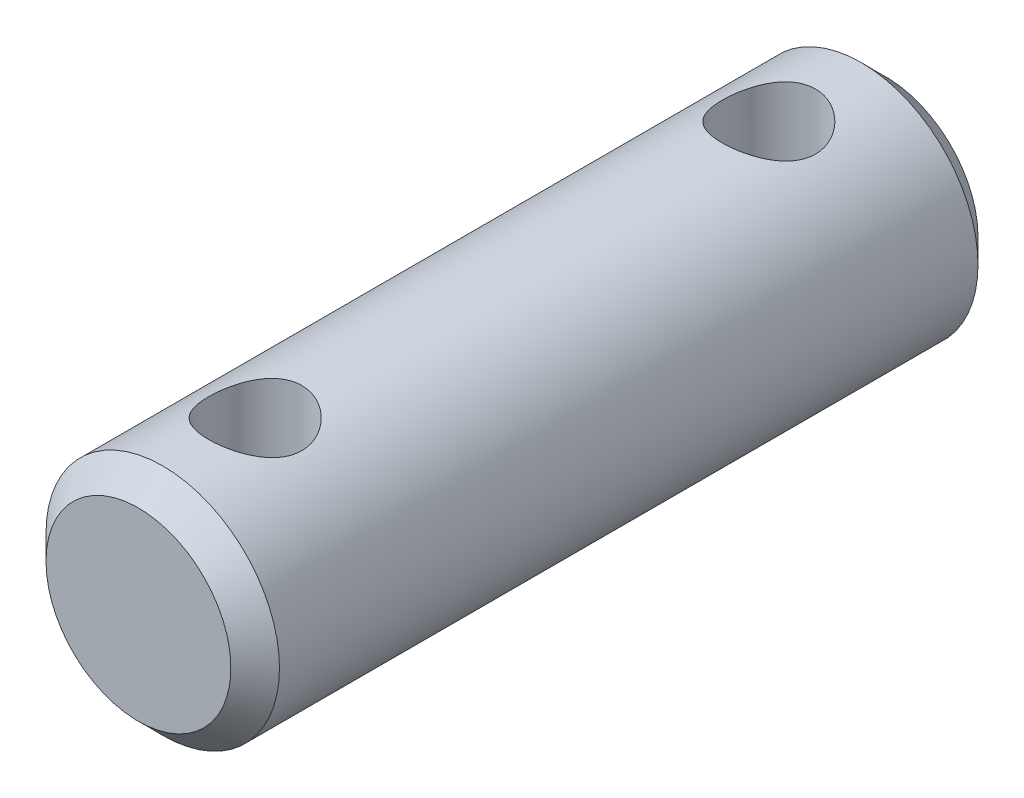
ISO-10303-21;
HEADER;
FILE_DESCRIPTION(('STEP AP214'),'2;1');
FILE_NAME('part.step','',(''),(''),'','','');
FILE_SCHEMA(('AUTOMOTIVE_DESIGN { 1 0 10303 214 1 1 1 1 }'));
ENDSEC;
DATA;
#1=APPLICATION_CONTEXT('core data for automotive mechanical design processes');
#2=APPLICATION_PROTOCOL_DEFINITION('international standard','automotive_design',2000,#1);
#3=PRODUCT_CONTEXT('',#1,'mechanical');
#4=PRODUCT('Part','Part','',(#3));
#5=PRODUCT_RELATED_PRODUCT_CATEGORY('part','',(#4));
#6=PRODUCT_DEFINITION_FORMATION('','',#4);
#7=PRODUCT_DEFINITION_CONTEXT('part definition',#1,'design');
#8=PRODUCT_DEFINITION('design','',#6,#7);
#9=PRODUCT_DEFINITION_SHAPE('','',#8);
#10=(LENGTH_UNIT() NAMED_UNIT(*) SI_UNIT(.MILLI.,.METRE.));
#11=(NAMED_UNIT(*) PLANE_ANGLE_UNIT() SI_UNIT($,.RADIAN.));
#12=(NAMED_UNIT(*) SI_UNIT($,.STERADIAN.) SOLID_ANGLE_UNIT());
#13=UNCERTAINTY_MEASURE_WITH_UNIT(LENGTH_MEASURE(1.E-05),#10,'distance_accuracy_value','');
#14=(GEOMETRIC_REPRESENTATION_CONTEXT(3) GLOBAL_UNCERTAINTY_ASSIGNED_CONTEXT((#13)) GLOBAL_UNIT_ASSIGNED_CONTEXT((#10,
#11,#12)) REPRESENTATION_CONTEXT('',''));
#15=CARTESIAN_POINT('',(0.,0.,0.));
#16=DIRECTION('',(0.,0.,1.));
#17=DIRECTION('',(1.,0.,0.));
#18=AXIS2_PLACEMENT_3D('',#15,#16,#17);
#19=CARTESIAN_POINT('',(0.,0.,12.7));
#20=DIRECTION('',(0.,0.,-1.));
#21=DIRECTION('',(-1.,0.,0.));
#22=AXIS2_PLACEMENT_3D('',#19,#20,#21);
#23=CYLINDRICAL_SURFACE('',#22,3.96875);
#24=CARTESIAN_POINT('',(0.,-3.96875,10.31875));
#25=CARTESIAN_POINT('',(0.085322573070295,-3.96874421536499,10.3187421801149));
#26=CARTESIAN_POINT('',(0.170793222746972,-3.96596627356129,10.3118302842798));
#27=CARTESIAN_POINT('',(0.339325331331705,-3.95512490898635,10.28442213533));
#28=CARTESIAN_POINT('',(0.422379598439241,-3.94704711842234,10.2638889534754));
#29=CARTESIAN_POINT('',(0.583369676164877,-3.92647653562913,10.2101046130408));
#30=CARTESIAN_POINT('',(0.661321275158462,-3.91399820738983,10.1768950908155));
#31=CARTESIAN_POINT('',(0.810475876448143,-3.88585559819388,10.098866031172));
#32=CARTESIAN_POINT('',(0.8816812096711,-3.87019242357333,10.0540505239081));
#33=CARTESIAN_POINT('',(1.018778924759,-3.8364389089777,9.95185057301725));
#34=CARTESIAN_POINT('',(1.08431192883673,-3.81827323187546,9.89400909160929));
#35=CARTESIAN_POINT('',(1.20505141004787,-3.78190582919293,9.76836374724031));
#36=CARTESIAN_POINT('',(1.26025283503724,-3.76370409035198,9.70055503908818));
#37=CARTESIAN_POINT('',(1.36118168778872,-3.72842465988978,9.5532352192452));
#38=CARTESIAN_POINT('',(1.40637814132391,-3.71143304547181,9.47333760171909));
#39=CARTESIAN_POINT('',(1.48253030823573,-3.68167957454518,9.30629298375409));
#40=CARTESIAN_POINT('',(1.51349278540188,-3.66891570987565,9.21914944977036));
#41=CARTESIAN_POINT('',(1.55884469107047,-3.64987171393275,9.04421583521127));
#42=CARTESIAN_POINT('',(1.57392208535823,-3.64332377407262,8.95663433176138));
#43=CARTESIAN_POINT('',(1.58922478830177,-3.63667678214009,8.77995847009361));
#44=CARTESIAN_POINT('',(1.58945740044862,-3.63657455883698,8.69086487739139));
#45=CARTESIAN_POINT('',(1.57558531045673,-3.64260209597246,8.52030564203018));
#46=CARTESIAN_POINT('',(1.5624772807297,-3.64829863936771,8.43874065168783));
#47=CARTESIAN_POINT('',(1.5239578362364,-3.66455473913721,8.27908272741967));
#48=CARTESIAN_POINT('',(1.49854427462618,-3.67511514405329,8.20099040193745));
#49=CARTESIAN_POINT('',(1.43565144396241,-3.70014091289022,8.0486108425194));
#50=CARTESIAN_POINT('',(1.39793651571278,-3.71468157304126,7.97443379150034));
#51=CARTESIAN_POINT('',(1.3116770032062,-3.74600879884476,7.83318869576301));
#52=CARTESIAN_POINT('',(1.2631283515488,-3.76279620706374,7.76612333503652));
#53=CARTESIAN_POINT('',(1.15216828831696,-3.79830597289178,7.63554977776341));
#54=CARTESIAN_POINT('',(1.08897536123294,-3.81707759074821,7.57271732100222));
#55=CARTESIAN_POINT('',(0.952749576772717,-3.85333736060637,7.45832544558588));
#56=CARTESIAN_POINT('',(0.879714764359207,-3.87082525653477,7.40676827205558));
#57=CARTESIAN_POINT('',(0.723961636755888,-3.90298528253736,7.31550365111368));
#58=CARTESIAN_POINT('',(0.641080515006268,-3.91759495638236,7.27605043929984));
#59=CARTESIAN_POINT('',(0.469125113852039,-3.94188019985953,7.21187926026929));
#60=CARTESIAN_POINT('',(0.38005400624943,-3.95155827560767,7.18715380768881));
#61=CARTESIAN_POINT('',(0.203911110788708,-3.96443310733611,7.15450666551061));
#62=CARTESIAN_POINT('',(0.117033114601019,-3.96797963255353,7.14567686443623));
#63=CARTESIAN_POINT('',(-0.0570272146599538,-3.96929354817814,7.14239022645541));
#64=CARTESIAN_POINT('',(-0.144209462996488,-3.96706243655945,7.14792966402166));
#65=CARTESIAN_POINT('',(-0.312287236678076,-3.95730068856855,7.17255657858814));
#66=CARTESIAN_POINT('',(-0.393289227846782,-3.9500126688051,7.19102414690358));
#67=CARTESIAN_POINT('',(-0.550969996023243,-3.93112181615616,7.24013959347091));
#68=CARTESIAN_POINT('',(-0.627648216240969,-3.91951842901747,7.27078903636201));
#69=CARTESIAN_POINT('',(-0.777143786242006,-3.89268172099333,7.34439804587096));
#70=CARTESIAN_POINT('',(-0.849771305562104,-3.8773482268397,7.38770546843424));
#71=CARTESIAN_POINT('',(-0.986983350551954,-3.84471358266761,7.4850151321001));
#72=CARTESIAN_POINT('',(-1.05156463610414,-3.82741164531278,7.53902165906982));
#73=CARTESIAN_POINT('',(-1.17532391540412,-3.79130812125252,7.66037807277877));
#74=CARTESIAN_POINT('',(-1.23386368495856,-3.77248294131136,7.72837349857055));
#75=CARTESIAN_POINT('',(-1.33885876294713,-3.73651202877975,7.87355556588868));
#76=CARTESIAN_POINT('',(-1.38531207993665,-3.71936657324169,7.95074371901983));
#77=CARTESIAN_POINT('',(-1.46510970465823,-3.68866975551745,8.11328522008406));
#78=CARTESIAN_POINT('',(-1.49832265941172,-3.67515482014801,8.19871042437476));
#79=CARTESIAN_POINT('',(-1.54963512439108,-3.65381915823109,8.3746448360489));
#80=CARTESIAN_POINT('',(-1.56774578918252,-3.64599422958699,8.46515023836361));
#81=CARTESIAN_POINT('',(-1.58727427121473,-3.63753208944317,8.64165777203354));
#82=CARTESIAN_POINT('',(-1.5897995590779,-3.63641815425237,8.72751527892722));
#83=CARTESIAN_POINT('',(-1.58099375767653,-3.64025526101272,8.89836998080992));
#84=CARTESIAN_POINT('',(-1.56966442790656,-3.64520553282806,8.98336728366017));
#85=CARTESIAN_POINT('',(-1.53437539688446,-3.66019277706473,9.14664492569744));
#86=CARTESIAN_POINT('',(-1.51093288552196,-3.67002085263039,9.22505796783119));
#87=CARTESIAN_POINT('',(-1.45256682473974,-3.69350925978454,9.3768692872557));
#88=CARTESIAN_POINT('',(-1.41764010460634,-3.70717064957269,9.45026617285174));
#89=CARTESIAN_POINT('',(-1.33498650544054,-3.73775771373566,9.59454013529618));
#90=CARTESIAN_POINT('',(-1.28664123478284,-3.75482550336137,9.66503231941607));
#91=CARTESIAN_POINT('',(-1.17942686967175,-3.78986894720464,9.79725094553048));
#92=CARTESIAN_POINT('',(-1.12055460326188,-3.80784487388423,9.85897473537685));
#93=CARTESIAN_POINT('',(-0.989413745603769,-3.8440801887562,9.97601101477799));
#94=CARTESIAN_POINT('',(-0.916524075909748,-3.86228239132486,10.0306483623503));
#95=CARTESIAN_POINT('',(-0.761920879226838,-3.89572822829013,10.1269300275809));
#96=CARTESIAN_POINT('',(-0.680203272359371,-3.91097048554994,10.1685683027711));
#97=CARTESIAN_POINT('',(-0.51176083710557,-3.9365214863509,10.2366938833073));
#98=CARTESIAN_POINT('',(-0.425157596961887,-3.94691681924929,10.263448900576));
#99=CARTESIAN_POINT('',(-0.248345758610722,-3.96195793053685,10.3017948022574));
#100=CARTESIAN_POINT('',(-0.158149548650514,-3.96662195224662,10.3134338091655));
#101=CARTESIAN_POINT('',(-0.0451741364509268,-3.96855870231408,10.3182700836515));
#102=CARTESIAN_POINT('',(-0.0225922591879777,-3.96875153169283,10.3187520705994));
#103=CARTESIAN_POINT('',(0.,-3.96875,10.31875));
#104=B_SPLINE_CURVE_WITH_KNOTS('',3,(#24,#25,#26,#27,#28,#29,#30,#31,#32,#33,#34,#35,#36,#37,
#38,#39,#40,#41,#42,#43,#44,#45,#46,#47,#48,#49,#50,#51,#52,#53,#54,#55,#56,#57,#58,#59,#60,#61,
#62,#63,#64,#65,#66,#67,#68,#69,#70,#71,#72,#73,#74,#75,#76,#77,#78,#79,#80,#81,#82,#83,#84,#85,
#86,#87,#88,#89,#90,#91,#92,#93,#94,#95,#96,#97,#98,#99,#100,#101,#102,#103),.UNSPECIFIED.,.T.,
.F.,(4,2,2,2,2,2,2,2,2,2,2,2,2,2,2,2,2,2,2,2,2,2,2,2,2,2,2,2,2,2,2,2,2,2,2,2,2,2,2,4),(0.,
0.255907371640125,0.512511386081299,0.768279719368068,1.02395935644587,1.2906167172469,
1.55740413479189,1.83606486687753,2.11459304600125,2.38048883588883,2.64625380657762,
2.89352298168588,3.14083531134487,3.39319493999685,3.64564947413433,3.91761939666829,
4.18964342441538,4.46704174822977,4.74429896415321,5.00514290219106,5.26591921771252,
5.51497861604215,5.76407001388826,6.02078038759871,6.27759380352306,6.55136226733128,
6.82517581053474,7.10164192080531,7.37790365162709,7.63428490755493,7.89063360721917,
8.13684490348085,8.38312423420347,8.64350465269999,8.90396366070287,9.18130961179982,
9.45878429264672,9.73109163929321,10.0025299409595,10.0702907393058),.UNSPECIFIED.);
#105=CARTESIAN_POINT('',(0.,-3.96875,10.31875));
#106=VERTEX_POINT('',#105);
#107=EDGE_CURVE('E10',#106,#106,#104,.T.);
#108=ORIENTED_EDGE('',*,*,#107,.T.);
#109=EDGE_LOOP('',(#108));
#110=FACE_BOUND('',#109,.T.);
#111=CARTESIAN_POINT('',(0.,3.96875,10.31875));
#112=CARTESIAN_POINT('',(-0.0853225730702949,3.96874421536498,10.3187421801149));
#113=CARTESIAN_POINT('',(-0.170793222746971,3.96596627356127,10.3118302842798));
#114=CARTESIAN_POINT('',(-0.339325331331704,3.95512490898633,10.28442213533));
#115=CARTESIAN_POINT('',(-0.422379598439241,3.94704711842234,10.2638889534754));
#116=CARTESIAN_POINT('',(-0.583369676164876,3.92647653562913,10.2101046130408));
#117=CARTESIAN_POINT('',(-0.66132127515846,3.91399820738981,10.1768950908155));
#118=CARTESIAN_POINT('',(-0.81047587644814,3.88585559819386,10.0988660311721));
#119=CARTESIAN_POINT('',(-0.881681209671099,3.87019242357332,10.0540505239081));
#120=CARTESIAN_POINT('',(-1.018778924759,3.8364389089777,9.95185057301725));
#121=CARTESIAN_POINT('',(-1.08431192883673,3.81827323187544,9.89400909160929));
#122=CARTESIAN_POINT('',(-1.20505141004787,3.78190582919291,9.76836374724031));
#123=CARTESIAN_POINT('',(-1.26025283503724,3.76370409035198,9.70055503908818));
#124=CARTESIAN_POINT('',(-1.36118168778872,3.72842465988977,9.5532352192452));
#125=CARTESIAN_POINT('',(-1.4063781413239,3.71143304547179,9.47333760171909));
#126=CARTESIAN_POINT('',(-1.48253030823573,3.68167957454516,9.30629298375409));
#127=CARTESIAN_POINT('',(-1.51349278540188,3.66891570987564,9.21914944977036));
#128=CARTESIAN_POINT('',(-1.55884469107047,3.64987171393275,9.04421583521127));
#129=CARTESIAN_POINT('',(-1.57392208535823,3.64332377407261,8.95663433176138));
#130=CARTESIAN_POINT('',(-1.58922478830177,3.63667678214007,8.77995847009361));
#131=CARTESIAN_POINT('',(-1.58945740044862,3.63657455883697,8.69086487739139));
#132=CARTESIAN_POINT('',(-1.57558531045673,3.64260209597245,8.52030564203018));
#133=CARTESIAN_POINT('',(-1.5624772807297,3.64829863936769,8.43874065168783));
#134=CARTESIAN_POINT('',(-1.5239578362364,3.66455473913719,8.27908272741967));
#135=CARTESIAN_POINT('',(-1.49854427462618,3.67511514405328,8.20099040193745));
#136=CARTESIAN_POINT('',(-1.43565144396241,3.70014091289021,8.0486108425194));
#137=CARTESIAN_POINT('',(-1.39793651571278,3.71468157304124,7.97443379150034));
#138=CARTESIAN_POINT('',(-1.3116770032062,3.74600879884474,7.83318869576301));
#139=CARTESIAN_POINT('',(-1.2631283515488,3.76279620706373,7.76612333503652));
#140=CARTESIAN_POINT('',(-1.15216828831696,3.79830597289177,7.63554977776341));
#141=CARTESIAN_POINT('',(-1.08897536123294,3.81707759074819,7.57271732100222));
#142=CARTESIAN_POINT('',(-0.952749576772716,3.85333736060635,7.45832544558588));
#143=CARTESIAN_POINT('',(-0.879714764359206,3.87082525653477,7.40676827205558));
#144=CARTESIAN_POINT('',(-0.723961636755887,3.90298528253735,7.31550365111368));
#145=CARTESIAN_POINT('',(-0.641080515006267,3.91759495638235,7.27605043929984));
#146=CARTESIAN_POINT('',(-0.469125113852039,3.94188019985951,7.21187926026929));
#147=CARTESIAN_POINT('',(-0.38005400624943,3.95155827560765,7.18715380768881));
#148=CARTESIAN_POINT('',(-0.203911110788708,3.9644331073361,7.15450666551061));
#149=CARTESIAN_POINT('',(-0.11703311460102,3.96797963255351,7.14567686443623));
#150=CARTESIAN_POINT('',(0.0570272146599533,3.96929354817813,7.14239022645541));
#151=CARTESIAN_POINT('',(0.144209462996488,3.96706243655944,7.14792966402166));
#152=CARTESIAN_POINT('',(0.312287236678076,3.95730068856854,7.17255657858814));
#153=CARTESIAN_POINT('',(0.393289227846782,3.95001266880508,7.19102414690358));
#154=CARTESIAN_POINT('',(0.550969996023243,3.93112181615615,7.24013959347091));
#155=CARTESIAN_POINT('',(0.627648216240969,3.91951842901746,7.27078903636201));
#156=CARTESIAN_POINT('',(0.777143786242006,3.89268172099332,7.34439804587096));
#157=CARTESIAN_POINT('',(0.849771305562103,3.87734822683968,7.38770546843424));
#158=CARTESIAN_POINT('',(0.986983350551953,3.84471358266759,7.4850151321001));
#159=CARTESIAN_POINT('',(1.05156463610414,3.82741164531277,7.53902165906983));
#160=CARTESIAN_POINT('',(1.17532391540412,3.79130812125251,7.66037807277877));
#161=CARTESIAN_POINT('',(1.23386368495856,3.77248294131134,7.72837349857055));
#162=CARTESIAN_POINT('',(1.33885876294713,3.73651202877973,7.87355556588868));
#163=CARTESIAN_POINT('',(1.38531207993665,3.71936657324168,7.95074371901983));
#164=CARTESIAN_POINT('',(1.46510970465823,3.68866975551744,8.11328522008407));
#165=CARTESIAN_POINT('',(1.49832265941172,3.67515482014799,8.19871042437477));
#166=CARTESIAN_POINT('',(1.54963512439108,3.65381915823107,8.3746448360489));
#167=CARTESIAN_POINT('',(1.56774578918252,3.64599422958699,8.46515023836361));
#168=CARTESIAN_POINT('',(1.58727427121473,3.63753208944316,8.64165777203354));
#169=CARTESIAN_POINT('',(1.5897995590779,3.63641815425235,8.72751527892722));
#170=CARTESIAN_POINT('',(1.58099375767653,3.6402552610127,8.89836998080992));
#171=CARTESIAN_POINT('',(1.56966442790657,3.64520553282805,8.98336728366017));
#172=CARTESIAN_POINT('',(1.53437539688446,3.66019277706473,9.14664492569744));
#173=CARTESIAN_POINT('',(1.51093288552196,3.67002085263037,9.22505796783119));
#174=CARTESIAN_POINT('',(1.45256682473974,3.69350925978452,9.3768692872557));
#175=CARTESIAN_POINT('',(1.41764010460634,3.70717064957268,9.45026617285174));
#176=CARTESIAN_POINT('',(1.33498650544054,3.73775771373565,9.59454013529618));
#177=CARTESIAN_POINT('',(1.28664123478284,3.75482550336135,9.66503231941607));
#178=CARTESIAN_POINT('',(1.17942686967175,3.78986894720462,9.79725094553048));
#179=CARTESIAN_POINT('',(1.12055460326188,3.80784487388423,9.85897473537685));
#180=CARTESIAN_POINT('',(0.989413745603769,3.84408018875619,9.97601101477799));
#181=CARTESIAN_POINT('',(0.916524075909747,3.86228239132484,10.0306483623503));
#182=CARTESIAN_POINT('',(0.761920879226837,3.89572822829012,10.1269300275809));
#183=CARTESIAN_POINT('',(0.680203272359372,3.91097048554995,10.1685683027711));
#184=CARTESIAN_POINT('',(0.511760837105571,3.9365214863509,10.2366938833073));
#185=CARTESIAN_POINT('',(0.425157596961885,3.94691681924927,10.263448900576));
#186=CARTESIAN_POINT('',(0.248345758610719,3.96195793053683,10.3017948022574));
#187=CARTESIAN_POINT('',(0.158149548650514,3.96662195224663,10.3134338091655));
#188=CARTESIAN_POINT('',(0.0451741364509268,3.96855870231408,10.3182700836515));
#189=CARTESIAN_POINT('',(0.0225922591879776,3.96875153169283,10.3187520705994));
#190=CARTESIAN_POINT('',(0.,3.96875,10.31875));
#191=B_SPLINE_CURVE_WITH_KNOTS('',3,(#111,#112,#113,#114,#115,#116,#117,#118,#119,#120,#121,
#122,#123,#124,#125,#126,#127,#128,#129,#130,#131,#132,#133,#134,#135,#136,#137,#138,#139,#140,
#141,#142,#143,#144,#145,#146,#147,#148,#149,#150,#151,#152,#153,#154,#155,#156,#157,#158,#159,
#160,#161,#162,#163,#164,#165,#166,#167,#168,#169,#170,#171,#172,#173,#174,#175,#176,#177,#178,
#179,#180,#181,#182,#183,#184,#185,#186,#187,#188,#189,#190),.UNSPECIFIED.,.T.,.F.,(4,2,2,2,2,2,
2,2,2,2,2,2,2,2,2,2,2,2,2,2,2,2,2,2,2,2,2,2,2,2,2,2,2,2,2,2,2,2,2,4),(0.,0.255907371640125,
0.512511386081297,0.768279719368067,1.02395935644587,1.2906167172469,1.55740413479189,
1.83606486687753,2.11459304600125,2.38048883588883,2.64625380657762,2.89352298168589,
3.14083531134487,3.39319493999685,3.64564947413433,3.91761939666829,4.18964342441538,
4.46704174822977,4.74429896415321,5.00514290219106,5.26591921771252,5.51497861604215,
5.76407001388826,6.02078038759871,6.27759380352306,6.55136226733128,6.82517581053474,
7.10164192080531,7.37790365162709,7.63428490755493,7.89063360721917,8.13684490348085,
8.38312423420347,8.64350465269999,8.90396366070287,9.18130961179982,9.45878429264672,
9.73109163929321,10.0025299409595,10.0702907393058),.UNSPECIFIED.);
#192=CARTESIAN_POINT('',(0.,3.96875,10.31875));
#193=VERTEX_POINT('',#192);
#194=EDGE_CURVE('E44',#193,#193,#191,.T.);
#195=ORIENTED_EDGE('',*,*,#194,.T.);
#196=EDGE_LOOP('',(#195));
#197=FACE_BOUND('',#196,.T.);
#198=CARTESIAN_POINT('',(0.,-3.96875,-7.14375));
#199=CARTESIAN_POINT('',(0.0853225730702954,-3.96874421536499,-7.14375781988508));
#200=CARTESIAN_POINT('',(0.170793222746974,-3.96596627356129,-7.15066971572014));
#201=CARTESIAN_POINT('',(0.339325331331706,-3.95512490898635,-7.17807786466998));
#202=CARTESIAN_POINT('',(0.422379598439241,-3.94704711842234,-7.19861104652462));
#203=CARTESIAN_POINT('',(0.583369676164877,-3.92647653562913,-7.2523953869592));
#204=CARTESIAN_POINT('',(0.661321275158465,-3.91399820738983,-7.28560490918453));
#205=CARTESIAN_POINT('',(0.810475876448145,-3.88585559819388,-7.36363396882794));
#206=CARTESIAN_POINT('',(0.8816812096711,-3.87019242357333,-7.4084494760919));
#207=CARTESIAN_POINT('',(1.018778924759,-3.8364389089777,-7.51064942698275));
#208=CARTESIAN_POINT('',(1.08431192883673,-3.81827323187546,-7.56849090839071));
#209=CARTESIAN_POINT('',(1.20505141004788,-3.78190582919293,-7.69413625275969));
#210=CARTESIAN_POINT('',(1.26025283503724,-3.76370409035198,-7.76194496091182));
#211=CARTESIAN_POINT('',(1.36118168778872,-3.72842465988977,-7.9092647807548));
#212=CARTESIAN_POINT('',(1.40637814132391,-3.71143304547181,-7.98916239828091));
#213=CARTESIAN_POINT('',(1.48253030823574,-3.68167957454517,-8.15620701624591));
#214=CARTESIAN_POINT('',(1.51349278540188,-3.66891570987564,-8.24335055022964));
#215=CARTESIAN_POINT('',(1.55884469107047,-3.64987171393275,-8.41828416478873));
#216=CARTESIAN_POINT('',(1.57392208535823,-3.64332377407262,-8.50586566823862));
#217=CARTESIAN_POINT('',(1.58922478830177,-3.63667678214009,-8.68254152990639));
#218=CARTESIAN_POINT('',(1.58945740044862,-3.63657455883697,-8.7716351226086));
#219=CARTESIAN_POINT('',(1.57558531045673,-3.64260209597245,-8.94219435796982));
#220=CARTESIAN_POINT('',(1.5624772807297,-3.64829863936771,-9.02375934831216));
#221=CARTESIAN_POINT('',(1.52395783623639,-3.66455473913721,-9.18341727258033));
#222=CARTESIAN_POINT('',(1.49854427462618,-3.67511514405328,-9.26150959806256));
#223=CARTESIAN_POINT('',(1.43565144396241,-3.70014091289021,-9.41388915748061));
#224=CARTESIAN_POINT('',(1.39793651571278,-3.71468157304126,-9.48806620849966));
#225=CARTESIAN_POINT('',(1.31167700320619,-3.74600879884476,-9.62931130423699));
#226=CARTESIAN_POINT('',(1.26312835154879,-3.76279620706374,-9.69637666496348));
#227=CARTESIAN_POINT('',(1.15216828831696,-3.79830597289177,-9.82695022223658));
#228=CARTESIAN_POINT('',(1.08897536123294,-3.81707759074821,-9.88978267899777));
#229=CARTESIAN_POINT('',(0.952749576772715,-3.85333736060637,-10.0041745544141));
#230=CARTESIAN_POINT('',(0.879714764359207,-3.87082525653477,-10.0557317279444));
#231=CARTESIAN_POINT('',(0.723961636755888,-3.90298528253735,-10.1469963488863));
#232=CARTESIAN_POINT('',(0.641080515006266,-3.91759495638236,-10.1864495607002));
#233=CARTESIAN_POINT('',(0.469125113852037,-3.94188019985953,-10.2506207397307));
#234=CARTESIAN_POINT('',(0.380054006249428,-3.95155827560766,-10.2753461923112));
#235=CARTESIAN_POINT('',(0.203911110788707,-3.9644331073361,-10.3079933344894));
#236=CARTESIAN_POINT('',(0.117033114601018,-3.96797963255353,-10.3168231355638));
#237=CARTESIAN_POINT('',(-0.0570272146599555,-3.96929354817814,-10.3201097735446));
#238=CARTESIAN_POINT('',(-0.14420946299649,-3.96706243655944,-10.3145703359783));
#239=CARTESIAN_POINT('',(-0.312287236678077,-3.95730068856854,-10.2899434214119));
#240=CARTESIAN_POINT('',(-0.393289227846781,-3.9500126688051,-10.2714758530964));
#241=CARTESIAN_POINT('',(-0.550969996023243,-3.93112181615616,-10.2223604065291));
#242=CARTESIAN_POINT('',(-0.62764821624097,-3.91951842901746,-10.191710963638));
#243=CARTESIAN_POINT('',(-0.777143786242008,-3.89268172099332,-10.118101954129));
#244=CARTESIAN_POINT('',(-0.849771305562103,-3.8773482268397,-10.0747945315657));
#245=CARTESIAN_POINT('',(-0.986983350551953,-3.84471358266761,-9.97748486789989));
#246=CARTESIAN_POINT('',(-1.05156463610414,-3.82741164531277,-9.92347834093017));
#247=CARTESIAN_POINT('',(-1.17532391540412,-3.79130812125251,-9.80212192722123));
#248=CARTESIAN_POINT('',(-1.23386368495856,-3.77248294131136,-9.73412650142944));
#249=CARTESIAN_POINT('',(-1.33885876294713,-3.73651202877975,-9.58894443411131));
#250=CARTESIAN_POINT('',(-1.38531207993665,-3.71936657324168,-9.51175628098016));
#251=CARTESIAN_POINT('',(-1.46510970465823,-3.68866975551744,-9.34921477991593));
#252=CARTESIAN_POINT('',(-1.49832265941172,-3.67515482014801,-9.26378957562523));
#253=CARTESIAN_POINT('',(-1.54963512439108,-3.65381915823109,-9.0878551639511));
#254=CARTESIAN_POINT('',(-1.56774578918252,-3.64599422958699,-8.99734976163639));
#255=CARTESIAN_POINT('',(-1.58727427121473,-3.63753208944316,-8.82084222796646));
#256=CARTESIAN_POINT('',(-1.5897995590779,-3.63641815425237,-8.73498472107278));
#257=CARTESIAN_POINT('',(-1.58099375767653,-3.64025526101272,-8.56413001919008));
#258=CARTESIAN_POINT('',(-1.56966442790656,-3.64520553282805,-8.47913271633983));
#259=CARTESIAN_POINT('',(-1.53437539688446,-3.66019277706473,-8.31585507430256));
#260=CARTESIAN_POINT('',(-1.51093288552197,-3.67002085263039,-8.23744203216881));
#261=CARTESIAN_POINT('',(-1.45256682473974,-3.69350925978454,-8.0856307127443));
#262=CARTESIAN_POINT('',(-1.41764010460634,-3.70717064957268,-8.01223382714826));
#263=CARTESIAN_POINT('',(-1.33498650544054,-3.73775771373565,-7.86795986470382));
#264=CARTESIAN_POINT('',(-1.28664123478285,-3.75482550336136,-7.79746768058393));
#265=CARTESIAN_POINT('',(-1.17942686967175,-3.78986894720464,-7.66524905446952));
#266=CARTESIAN_POINT('',(-1.12055460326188,-3.80784487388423,-7.60352526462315));
#267=CARTESIAN_POINT('',(-0.989413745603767,-3.84408018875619,-7.48648898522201));
#268=CARTESIAN_POINT('',(-0.916524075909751,-3.86228239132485,-7.43185163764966));
#269=CARTESIAN_POINT('',(-0.761920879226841,-3.89572822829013,-7.33556997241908));
#270=CARTESIAN_POINT('',(-0.680203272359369,-3.91097048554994,-7.29393169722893));
#271=CARTESIAN_POINT('',(-0.511760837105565,-3.9365214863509,-7.22580611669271));
#272=CARTESIAN_POINT('',(-0.425157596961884,-3.94691681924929,-7.19905109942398));
#273=CARTESIAN_POINT('',(-0.24834575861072,-3.96195793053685,-7.16070519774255));
#274=CARTESIAN_POINT('',(-0.158149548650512,-3.96662195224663,-7.14906619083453));
#275=CARTESIAN_POINT('',(-0.045174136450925,-3.96855870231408,-7.14422991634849));
#276=CARTESIAN_POINT('',(-0.0225922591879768,-3.96875153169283,-7.14374792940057));
#277=CARTESIAN_POINT('',(0.,-3.96875,-7.14375));
#278=B_SPLINE_CURVE_WITH_KNOTS('',3,(#198,#199,#200,#201,#202,#203,#204,#205,#206,#207,#208,
#209,#210,#211,#212,#213,#214,#215,#216,#217,#218,#219,#220,#221,#222,#223,#224,#225,#226,#227,
#228,#229,#230,#231,#232,#233,#234,#235,#236,#237,#238,#239,#240,#241,#242,#243,#244,#245,#246,
#247,#248,#249,#250,#251,#252,#253,#254,#255,#256,#257,#258,#259,#260,#261,#262,#263,#264,#265,
#266,#267,#268,#269,#270,#271,#272,#273,#274,#275,#276,#277),.UNSPECIFIED.,.T.,.F.,(4,2,2,2,2,2,
2,2,2,2,2,2,2,2,2,2,2,2,2,2,2,2,2,2,2,2,2,2,2,2,2,2,2,2,2,2,2,2,2,4),(0.,0.255907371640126,
0.512511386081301,0.76827971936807,1.02395935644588,1.2906167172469,1.55740413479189,
1.83606486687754,2.11459304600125,2.38048883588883,2.64625380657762,2.89352298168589,
3.14083531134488,3.39319493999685,3.64564947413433,3.91761939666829,4.18964342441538,
4.46704174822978,4.74429896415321,5.00514290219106,5.26591921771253,5.51497861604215,
5.76407001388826,6.02078038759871,6.27759380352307,6.55136226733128,6.82517581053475,
7.10164192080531,7.37790365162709,7.63428490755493,7.89063360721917,8.13684490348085,
8.38312423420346,8.64350465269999,8.90396366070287,9.18130961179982,9.45878429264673,
9.73109163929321,10.0025299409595,10.0702907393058),.UNSPECIFIED.);
#279=CARTESIAN_POINT('',(0.,-3.96875,-7.14375));
#280=VERTEX_POINT('',#279);
#281=EDGE_CURVE('E48',#280,#280,#278,.T.);
#282=ORIENTED_EDGE('',*,*,#281,.T.);
#283=EDGE_LOOP('',(#282));
#284=FACE_BOUND('',#283,.T.);
#285=CARTESIAN_POINT('',(0.,3.96875,-7.14375));
#286=CARTESIAN_POINT('',(-0.0853225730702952,3.96874421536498,-7.14375781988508));
#287=CARTESIAN_POINT('',(-0.170793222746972,3.96596627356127,-7.15066971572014));
#288=CARTESIAN_POINT('',(-0.339325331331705,3.95512490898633,-7.17807786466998));
#289=CARTESIAN_POINT('',(-0.42237959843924,3.94704711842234,-7.19861104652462));
#290=CARTESIAN_POINT('',(-0.583369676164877,3.92647653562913,-7.2523953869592));
#291=CARTESIAN_POINT('',(-0.661321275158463,3.91399820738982,-7.28560490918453));
#292=CARTESIAN_POINT('',(-0.810475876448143,3.88585559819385,-7.36363396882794));
#293=CARTESIAN_POINT('',(-0.881681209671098,3.87019242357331,-7.4084494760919));
#294=CARTESIAN_POINT('',(-1.018778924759,3.83643890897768,-7.51064942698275));
#295=CARTESIAN_POINT('',(-1.08431192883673,3.81827323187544,-7.56849090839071));
#296=CARTESIAN_POINT('',(-1.20505141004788,3.78190582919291,-7.69413625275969));
#297=CARTESIAN_POINT('',(-1.26025283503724,3.76370409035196,-7.76194496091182));
#298=CARTESIAN_POINT('',(-1.36118168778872,3.72842465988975,-7.9092647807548));
#299=CARTESIAN_POINT('',(-1.40637814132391,3.71143304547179,-7.98916239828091));
#300=CARTESIAN_POINT('',(-1.48253030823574,3.68167957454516,-8.15620701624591));
#301=CARTESIAN_POINT('',(-1.51349278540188,3.66891570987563,-8.24335055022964));
#302=CARTESIAN_POINT('',(-1.55884469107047,3.64987171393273,-8.41828416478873));
#303=CARTESIAN_POINT('',(-1.57392208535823,3.64332377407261,-8.50586566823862));
#304=CARTESIAN_POINT('',(-1.58922478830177,3.63667678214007,-8.68254152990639));
#305=CARTESIAN_POINT('',(-1.58945740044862,3.63657455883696,-8.7716351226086));
#306=CARTESIAN_POINT('',(-1.57558531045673,3.64260209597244,-8.94219435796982));
#307=CARTESIAN_POINT('',(-1.5624772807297,3.64829863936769,-9.02375934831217));
#308=CARTESIAN_POINT('',(-1.52395783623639,3.66455473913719,-9.18341727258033));
#309=CARTESIAN_POINT('',(-1.49854427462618,3.67511514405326,-9.26150959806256));
#310=CARTESIAN_POINT('',(-1.43565144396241,3.70014091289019,-9.41388915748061));
#311=CARTESIAN_POINT('',(-1.39793651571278,3.71468157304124,-9.48806620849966));
#312=CARTESIAN_POINT('',(-1.31167700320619,3.74600879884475,-9.62931130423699));
#313=CARTESIAN_POINT('',(-1.26312835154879,3.76279620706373,-9.69637666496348));
#314=CARTESIAN_POINT('',(-1.15216828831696,3.79830597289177,-9.82695022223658));
#315=CARTESIAN_POINT('',(-1.08897536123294,3.81707759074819,-9.88978267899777));
#316=CARTESIAN_POINT('',(-0.952749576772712,3.85333736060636,-10.0041745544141));
#317=CARTESIAN_POINT('',(-0.879714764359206,3.87082525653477,-10.0557317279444));
#318=CARTESIAN_POINT('',(-0.723961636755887,3.90298528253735,-10.1469963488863));
#319=CARTESIAN_POINT('',(-0.641080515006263,3.91759495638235,-10.1864495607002));
#320=CARTESIAN_POINT('',(-0.469125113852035,3.94188019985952,-10.2506207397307));
#321=CARTESIAN_POINT('',(-0.380054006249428,3.95155827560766,-10.2753461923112));
#322=CARTESIAN_POINT('',(-0.203911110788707,3.9644331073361,-10.3079933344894));
#323=CARTESIAN_POINT('',(-0.117033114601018,3.96797963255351,-10.3168231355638));
#324=CARTESIAN_POINT('',(0.0570272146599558,3.96929354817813,-10.3201097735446));
#325=CARTESIAN_POINT('',(0.14420946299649,3.96706243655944,-10.3145703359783));
#326=CARTESIAN_POINT('',(0.312287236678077,3.95730068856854,-10.2899434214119));
#327=CARTESIAN_POINT('',(0.39328922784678,3.95001266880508,-10.2714758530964));
#328=CARTESIAN_POINT('',(0.550969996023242,3.93112181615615,-10.2223604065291));
#329=CARTESIAN_POINT('',(0.62764821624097,3.91951842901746,-10.191710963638));
#330=CARTESIAN_POINT('',(0.777143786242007,3.89268172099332,-10.118101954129));
#331=CARTESIAN_POINT('',(0.849771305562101,3.87734822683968,-10.0747945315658));
#332=CARTESIAN_POINT('',(0.986983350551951,3.84471358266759,-9.97748486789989));
#333=CARTESIAN_POINT('',(1.05156463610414,3.82741164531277,-9.92347834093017));
#334=CARTESIAN_POINT('',(1.17532391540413,3.79130812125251,-9.80212192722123));
#335=CARTESIAN_POINT('',(1.23386368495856,3.77248294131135,-9.73412650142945));
#336=CARTESIAN_POINT('',(1.33885876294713,3.73651202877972,-9.58894443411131));
#337=CARTESIAN_POINT('',(1.38531207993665,3.71936657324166,-9.51175628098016));
#338=CARTESIAN_POINT('',(1.46510970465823,3.68866975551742,-9.34921477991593));
#339=CARTESIAN_POINT('',(1.49832265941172,3.675154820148,-9.26378957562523));
#340=CARTESIAN_POINT('',(1.54963512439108,3.65381915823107,-9.0878551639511));
#341=CARTESIAN_POINT('',(1.56774578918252,3.64599422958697,-8.99734976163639));
#342=CARTESIAN_POINT('',(1.58727427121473,3.63753208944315,-8.82084222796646));
#343=CARTESIAN_POINT('',(1.5897995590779,3.63641815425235,-8.73498472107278));
#344=CARTESIAN_POINT('',(1.58099375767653,3.6402552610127,-8.56413001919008));
#345=CARTESIAN_POINT('',(1.56966442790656,3.64520553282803,-8.47913271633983));
#346=CARTESIAN_POINT('',(1.53437539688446,3.66019277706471,-8.31585507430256));
#347=CARTESIAN_POINT('',(1.51093288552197,3.67002085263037,-8.23744203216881));
#348=CARTESIAN_POINT('',(1.45256682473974,3.69350925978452,-8.0856307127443));
#349=CARTESIAN_POINT('',(1.41764010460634,3.70717064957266,-8.01223382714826));
#350=CARTESIAN_POINT('',(1.33498650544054,3.73775771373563,-7.86795986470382));
#351=CARTESIAN_POINT('',(1.28664123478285,3.75482550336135,-7.79746768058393));
#352=CARTESIAN_POINT('',(1.17942686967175,3.78986894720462,-7.66524905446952));
#353=CARTESIAN_POINT('',(1.12055460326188,3.80784487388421,-7.60352526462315));
#354=CARTESIAN_POINT('',(0.989413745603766,3.84408018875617,-7.48648898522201));
#355=CARTESIAN_POINT('',(0.916524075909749,3.86228239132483,-7.43185163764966));
#356=CARTESIAN_POINT('',(0.76192087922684,3.89572822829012,-7.33556997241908));
#357=CARTESIAN_POINT('',(0.68020327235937,3.91097048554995,-7.29393169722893));
#358=CARTESIAN_POINT('',(0.511760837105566,3.9365214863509,-7.22580611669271));
#359=CARTESIAN_POINT('',(0.425157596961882,3.94691681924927,-7.19905109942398));
#360=CARTESIAN_POINT('',(0.248345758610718,3.96195793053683,-7.16070519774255));
#361=CARTESIAN_POINT('',(0.158149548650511,3.96662195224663,-7.14906619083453));
#362=CARTESIAN_POINT('',(0.045174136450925,3.96855870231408,-7.14422991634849));
#363=CARTESIAN_POINT('',(0.0225922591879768,3.96875153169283,-7.14374792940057));
#364=CARTESIAN_POINT('',(0.,3.96875,-7.14375));
#365=B_SPLINE_CURVE_WITH_KNOTS('',3,(#285,#286,#287,#288,#289,#290,#291,#292,#293,#294,#295,
#296,#297,#298,#299,#300,#301,#302,#303,#304,#305,#306,#307,#308,#309,#310,#311,#312,#313,#314,
#315,#316,#317,#318,#319,#320,#321,#322,#323,#324,#325,#326,#327,#328,#329,#330,#331,#332,#333,
#334,#335,#336,#337,#338,#339,#340,#341,#342,#343,#344,#345,#346,#347,#348,#349,#350,#351,#352,
#353,#354,#355,#356,#357,#358,#359,#360,#361,#362,#363,#364),.UNSPECIFIED.,.T.,.F.,(4,2,2,2,2,2,
2,2,2,2,2,2,2,2,2,2,2,2,2,2,2,2,2,2,2,2,2,2,2,2,2,2,2,2,2,2,2,2,2,4),(0.,0.255907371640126,
0.512511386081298,0.768279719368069,1.02395935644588,1.2906167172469,1.55740413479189,
1.83606486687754,2.11459304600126,2.38048883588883,2.64625380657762,2.89352298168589,
3.14083531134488,3.39319493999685,3.64564947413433,3.9176193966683,4.18964342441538,
4.46704174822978,4.74429896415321,5.00514290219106,5.26591921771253,5.51497861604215,
5.76407001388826,6.02078038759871,6.27759380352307,6.55136226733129,6.82517581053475,
7.10164192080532,7.3779036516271,7.63428490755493,7.89063360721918,8.13684490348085,
8.38312423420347,8.64350465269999,8.90396366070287,9.18130961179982,9.45878429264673,
9.73109163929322,10.0025299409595,10.0702907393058),.UNSPECIFIED.);
#366=CARTESIAN_POINT('',(0.,3.96875,-7.14375));
#367=VERTEX_POINT('',#366);
#368=EDGE_CURVE('E52',#367,#367,#365,.T.);
#369=ORIENTED_EDGE('',*,*,#368,.T.);
#370=EDGE_LOOP('',(#369));
#371=FACE_BOUND('',#370,.T.);
#372=CARTESIAN_POINT('',(0.,0.,-11.8745));
#373=DIRECTION('',(0.,0.,1.));
#374=DIRECTION('',(1.,0.,0.));
#375=AXIS2_PLACEMENT_3D('',#372,#373,#374);
#376=CIRCLE('',#375,3.96875);
#377=CARTESIAN_POINT('',(3.96875,0.,-11.8745));
#378=VERTEX_POINT('',#377);
#379=EDGE_CURVE('E83',#378,#378,#376,.T.);
#380=ORIENTED_EDGE('',*,*,#379,.T.);
#381=EDGE_LOOP('',(#380));
#382=FACE_BOUND('',#381,.T.);
#383=CARTESIAN_POINT('',(0.,0.,11.8745));
#384=DIRECTION('',(0.,0.,1.));
#385=DIRECTION('',(1.,0.,0.));
#386=AXIS2_PLACEMENT_3D('',#383,#384,#385);
#387=CIRCLE('',#386,3.96875);
#388=CARTESIAN_POINT('',(-3.96875,0.,11.8745));
#389=VERTEX_POINT('',#388);
#390=EDGE_CURVE('E86',#389,#389,#387,.F.);
#391=ORIENTED_EDGE('',*,*,#390,.T.);
#392=EDGE_LOOP('',(#391));
#393=FACE_BOUND('',#392,.T.);
#394=ADVANCED_FACE('F34',(#110,#197,#284,#371,#382,#393),#23,.T.);
#395=CARTESIAN_POINT('',(0.,0.,12.7));
#396=DIRECTION('',(0.,0.,1.));
#397=DIRECTION('',(1.,0.,0.));
#398=AXIS2_PLACEMENT_3D('',#395,#396,#397);
#399=PLANE('',#398);
#400=CARTESIAN_POINT('',(0.,0.,12.7));
#401=DIRECTION('',(0.,0.,1.));
#402=DIRECTION('',(1.,0.,0.));
#403=AXIS2_PLACEMENT_3D('',#400,#401,#402);
#404=CIRCLE('',#403,3.14325);
#405=CARTESIAN_POINT('',(-3.14325,0.,12.7));
#406=VERTEX_POINT('',#405);
#407=EDGE_CURVE('E77',#406,#406,#404,.T.);
#408=ORIENTED_EDGE('',*,*,#407,.T.);
#409=EDGE_LOOP('',(#408));
#410=FACE_BOUND('',#409,.T.);
#411=ADVANCED_FACE('F96',(#410),#399,.T.);
#412=CARTESIAN_POINT('',(0.,0.,-12.7));
#413=DIRECTION('',(0.,0.,1.));
#414=DIRECTION('',(1.,0.,0.));
#415=AXIS2_PLACEMENT_3D('',#412,#413,#414);
#416=PLANE('',#415);
#417=CARTESIAN_POINT('',(0.,0.,-12.7));
#418=DIRECTION('',(0.,0.,1.));
#419=DIRECTION('',(1.,0.,0.));
#420=AXIS2_PLACEMENT_3D('',#417,#418,#419);
#421=CIRCLE('',#420,3.14325);
#422=CARTESIAN_POINT('',(3.14325,0.,-12.7));
#423=VERTEX_POINT('',#422);
#424=EDGE_CURVE('E80',#423,#423,#421,.F.);
#425=ORIENTED_EDGE('',*,*,#424,.T.);
#426=EDGE_LOOP('',(#425));
#427=FACE_BOUND('',#426,.T.);
#428=ADVANCED_FACE('F98',(#427),#416,.F.);
#429=CARTESIAN_POINT('',(0.,0.,-11.8745));
#430=DIRECTION('',(0.,0.,1.));
#431=DIRECTION('',(1.,0.,0.));
#432=AXIS2_PLACEMENT_3D('',#429,#430,#431);
#433=CONICAL_SURFACE('',#432,3.96875,0.785398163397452);
#434=ORIENTED_EDGE('',*,*,#424,.F.);
#435=EDGE_LOOP('',(#434));
#436=FACE_BOUND('',#435,.T.);
#437=ORIENTED_EDGE('',*,*,#379,.F.);
#438=EDGE_LOOP('',(#437));
#439=FACE_BOUND('',#438,.T.);
#440=ADVANCED_FACE('F93',(#436,#439),#433,.T.);
#441=CARTESIAN_POINT('',(0.,0.,12.7));
#442=DIRECTION('',(0.,0.,-1.));
#443=DIRECTION('',(-1.,0.,0.));
#444=AXIS2_PLACEMENT_3D('',#441,#442,#443);
#445=CONICAL_SURFACE('',#444,3.14325,0.785398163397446);
#446=CARTESIAN_POINT('',(-3.96875,0.,11.8745));
#447=CARTESIAN_POINT('',(-3.96015104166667,0.,11.8830989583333));
#448=CARTESIAN_POINT('',(-3.95155208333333,0.,11.8916979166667));
#449=CARTESIAN_POINT('',(-3.93435416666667,0.,11.9088958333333));
#450=CARTESIAN_POINT('',(-3.92575520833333,0.,11.9174947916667));
#451=CARTESIAN_POINT('',(-3.90855729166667,0.,11.9346927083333));
#452=CARTESIAN_POINT('',(-3.89995833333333,0.,11.9432916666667));
#453=CARTESIAN_POINT('',(-3.88276041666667,0.,11.9604895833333));
#454=CARTESIAN_POINT('',(-3.87416145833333,0.,11.9690885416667));
#455=CARTESIAN_POINT('',(-3.85696354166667,0.,11.9862864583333));
#456=CARTESIAN_POINT('',(-3.84836458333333,0.,11.9948854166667));
#457=CARTESIAN_POINT('',(-3.83116666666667,0.,12.0120833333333));
#458=CARTESIAN_POINT('',(-3.82256770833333,0.,12.0206822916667));
#459=CARTESIAN_POINT('',(-3.80536979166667,0.,12.0378802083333));
#460=CARTESIAN_POINT('',(-3.79677083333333,0.,12.0464791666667));
#461=CARTESIAN_POINT('',(-3.77957291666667,0.,12.0636770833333));
#462=CARTESIAN_POINT('',(-3.77097395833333,0.,12.0722760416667));
#463=CARTESIAN_POINT('',(-3.75377604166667,0.,12.0894739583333));
#464=CARTESIAN_POINT('',(-3.74517708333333,0.,12.0980729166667));
#465=CARTESIAN_POINT('',(-3.72797916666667,0.,12.1152708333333));
#466=CARTESIAN_POINT('',(-3.71938020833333,0.,12.1238697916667));
#467=CARTESIAN_POINT('',(-3.70218229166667,0.,12.1410677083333));
#468=CARTESIAN_POINT('',(-3.69358333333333,0.,12.1496666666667));
#469=CARTESIAN_POINT('',(-3.67638541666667,0.,12.1668645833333));
#470=CARTESIAN_POINT('',(-3.66778645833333,0.,12.1754635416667));
#471=CARTESIAN_POINT('',(-3.65058854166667,0.,12.1926614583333));
#472=CARTESIAN_POINT('',(-3.64198958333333,0.,12.2012604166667));
#473=CARTESIAN_POINT('',(-3.62479166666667,0.,12.2184583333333));
#474=CARTESIAN_POINT('',(-3.61619270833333,0.,12.2270572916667));
#475=CARTESIAN_POINT('',(-3.59899479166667,0.,12.2442552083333));
#476=CARTESIAN_POINT('',(-3.59039583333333,0.,12.2528541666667));
#477=CARTESIAN_POINT('',(-3.57319791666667,0.,12.2700520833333));
#478=CARTESIAN_POINT('',(-3.56459895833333,0.,12.2786510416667));
#479=CARTESIAN_POINT('',(-3.54740104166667,0.,12.2958489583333));
#480=CARTESIAN_POINT('',(-3.53880208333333,0.,12.3044479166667));
#481=CARTESIAN_POINT('',(-3.52160416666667,0.,12.3216458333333));
#482=CARTESIAN_POINT('',(-3.51300520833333,0.,12.3302447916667));
#483=CARTESIAN_POINT('',(-3.49580729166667,0.,12.3474427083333));
#484=CARTESIAN_POINT('',(-3.48720833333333,0.,12.3560416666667));
#485=CARTESIAN_POINT('',(-3.47001041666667,0.,12.3732395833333));
#486=CARTESIAN_POINT('',(-3.46141145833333,0.,12.3818385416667));
#487=CARTESIAN_POINT('',(-3.44421354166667,0.,12.3990364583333));
#488=CARTESIAN_POINT('',(-3.43561458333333,0.,12.4076354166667));
#489=CARTESIAN_POINT('',(-3.41841666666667,0.,12.4248333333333));
#490=CARTESIAN_POINT('',(-3.40981770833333,0.,12.4334322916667));
#491=CARTESIAN_POINT('',(-3.39261979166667,0.,12.4506302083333));
#492=CARTESIAN_POINT('',(-3.38402083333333,0.,12.4592291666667));
#493=CARTESIAN_POINT('',(-3.36682291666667,0.,12.4764270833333));
#494=CARTESIAN_POINT('',(-3.35822395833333,0.,12.4850260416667));
#495=CARTESIAN_POINT('',(-3.34102604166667,0.,12.5022239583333));
#496=CARTESIAN_POINT('',(-3.33242708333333,0.,12.5108229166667));
#497=CARTESIAN_POINT('',(-3.31522916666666,0.,12.5280208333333));
#498=CARTESIAN_POINT('',(-3.30663020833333,0.,12.5366197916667));
#499=CARTESIAN_POINT('',(-3.28943229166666,0.,12.5538177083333));
#500=CARTESIAN_POINT('',(-3.28083333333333,0.,12.5624166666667));
#501=CARTESIAN_POINT('',(-3.26363541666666,0.,12.5796145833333));
#502=CARTESIAN_POINT('',(-3.25503645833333,0.,12.5882135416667));
#503=CARTESIAN_POINT('',(-3.23783854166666,0.,12.6054114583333));
#504=CARTESIAN_POINT('',(-3.22923958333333,0.,12.6140104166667));
#505=CARTESIAN_POINT('',(-3.21204166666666,0.,12.6312083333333));
#506=CARTESIAN_POINT('',(-3.20344270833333,0.,12.6398072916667));
#507=CARTESIAN_POINT('',(-3.18624479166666,0.,12.6570052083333));
#508=CARTESIAN_POINT('',(-3.17764583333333,0.,12.6656041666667));
#509=CARTESIAN_POINT('',(-3.16044791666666,0.,12.6828020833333));
#510=CARTESIAN_POINT('',(-3.15184895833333,0.,12.6914010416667));
#511=CARTESIAN_POINT('',(-3.14325,0.,12.7));
#512=B_SPLINE_CURVE_WITH_KNOTS('',3,(#446,#447,#448,#449,#450,#451,#452,#453,#454,#455,#456,
#457,#458,#459,#460,#461,#462,#463,#464,#465,#466,#467,#468,#469,#470,#471,#472,#473,#474,#475,
#476,#477,#478,#479,#480,#481,#482,#483,#484,#485,#486,#487,#488,#489,#490,#491,#492,#493,#494,
#495,#496,#497,#498,#499,#500,#501,#502,#503,#504,#505,#506,#507,#508,#509,#510,#511),
.UNSPECIFIED.,.F.,.F.,(4,2,2,2,2,2,2,2,2,2,2,2,2,2,2,2,2,2,2,2,2,2,2,2,2,2,2,2,2,2,2,2,4),(0.,
0.0364822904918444,0.0729645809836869,0.109446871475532,0.145929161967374,0.182411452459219,
0.218893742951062,0.255376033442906,0.291858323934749,0.328340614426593,0.364822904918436,
0.401305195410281,0.437787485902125,0.474269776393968,0.510752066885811,0.547234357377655,
0.583716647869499,0.620198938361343,0.656681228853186,0.69316351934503,0.729645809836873,
0.766128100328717,0.80261039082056,0.839092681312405,0.875574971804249,0.912057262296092,
0.948539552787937,0.985021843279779,1.02150413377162,1.05798642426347,1.09446871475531,
1.13095100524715,1.167433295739),.UNSPECIFIED.);
#513=EDGE_CURVE('BSEAM69',#389,#406,#512,.T.);
#514=ORIENTED_EDGE('',*,*,#390,.F.);
#515=ORIENTED_EDGE('',*,*,#407,.F.);
#516=ORIENTED_EDGE('',*,*,#513,.T.);
#517=ORIENTED_EDGE('',*,*,#513,.F.);
#518=EDGE_LOOP('',(#514,#516,#515,#517));
#519=FACE_BOUND('',#518,.T.);
#520=ADVANCED_FACE('F69',(#519),#445,.T.);
#521=CARTESIAN_POINT('',(0.,-3.96875,-8.73125));
#522=DIRECTION('',(0.,1.,0.));
#523=DIRECTION('',(0.,0.,1.));
#524=AXIS2_PLACEMENT_3D('',#521,#522,#523);
#525=CYLINDRICAL_SURFACE('',#524,1.5875);
#526=ORIENTED_EDGE('',*,*,#368,.F.);
#527=EDGE_LOOP('',(#526));
#528=FACE_BOUND('',#527,.T.);
#529=ORIENTED_EDGE('',*,*,#281,.F.);
#530=EDGE_LOOP('',(#529));
#531=FACE_BOUND('',#530,.T.);
#532=ADVANCED_FACE('F63',(#528,#531),#525,.F.);
#533=CARTESIAN_POINT('',(0.,-3.96875,8.73125));
#534=DIRECTION('',(0.,1.,0.));
#535=DIRECTION('',(0.,0.,1.));
#536=AXIS2_PLACEMENT_3D('',#533,#534,#535);
#537=CYLINDRICAL_SURFACE('',#536,1.5875);
#538=ORIENTED_EDGE('',*,*,#194,.F.);
#539=EDGE_LOOP('',(#538));
#540=FACE_BOUND('',#539,.T.);
#541=ORIENTED_EDGE('',*,*,#107,.F.);
#542=EDGE_LOOP('',(#541));
#543=FACE_BOUND('',#542,.T.);
#544=ADVANCED_FACE('F60',(#540,#543),#537,.F.);
#545=CLOSED_SHELL('',(#394,#411,#428,#440,#520,#532,#544));
#546=MANIFOLD_SOLID_BREP('B2',#545);
#547=ADVANCED_BREP_SHAPE_REPRESENTATION('',(#18,#546),#14);
#548=SHAPE_DEFINITION_REPRESENTATION(#9,#547);
ENDSEC;
END-ISO-10303-21;
